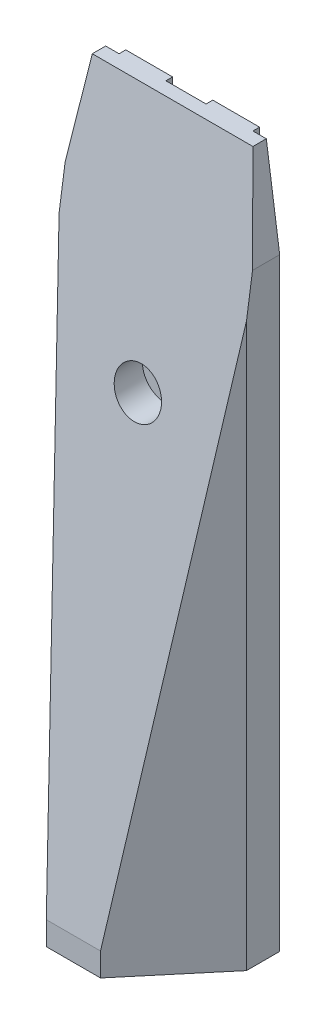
ISO-10303-21;
HEADER;
FILE_DESCRIPTION(('STEP AP214'),'2;1');
FILE_NAME('part.step','',(''),(''),'','','');
FILE_SCHEMA(('AUTOMOTIVE_DESIGN { 1 0 10303 214 1 1 1 1 }'));
ENDSEC;
DATA;
#1=APPLICATION_CONTEXT('core data for automotive mechanical design processes');
#2=APPLICATION_PROTOCOL_DEFINITION('international standard','automotive_design',2000,#1);
#3=PRODUCT_CONTEXT('',#1,'mechanical');
#4=PRODUCT('Part','Part','',(#3));
#5=PRODUCT_RELATED_PRODUCT_CATEGORY('part','',(#4));
#6=PRODUCT_DEFINITION_FORMATION('','',#4);
#7=PRODUCT_DEFINITION_CONTEXT('part definition',#1,'design');
#8=PRODUCT_DEFINITION('design','',#6,#7);
#9=PRODUCT_DEFINITION_SHAPE('','',#8);
#10=(LENGTH_UNIT() NAMED_UNIT(*) SI_UNIT(.MILLI.,.METRE.));
#11=(NAMED_UNIT(*) PLANE_ANGLE_UNIT() SI_UNIT($,.RADIAN.));
#12=(NAMED_UNIT(*) SI_UNIT($,.STERADIAN.) SOLID_ANGLE_UNIT());
#13=UNCERTAINTY_MEASURE_WITH_UNIT(LENGTH_MEASURE(1.E-05),#10,'distance_accuracy_value','');
#14=(GEOMETRIC_REPRESENTATION_CONTEXT(3) GLOBAL_UNCERTAINTY_ASSIGNED_CONTEXT((#13)) GLOBAL_UNIT_ASSIGNED_CONTEXT((#10,
#11,#12)) REPRESENTATION_CONTEXT('',''));
#15=CARTESIAN_POINT('',(0.,0.,0.));
#16=DIRECTION('',(0.,0.,1.));
#17=DIRECTION('',(1.,0.,0.));
#18=AXIS2_PLACEMENT_3D('',#15,#16,#17);
#19=CARTESIAN_POINT('',(10.85,38.08,0.));
#20=DIRECTION('',(-1.,0.,0.));
#21=DIRECTION('',(0.,0.,1.));
#22=AXIS2_PLACEMENT_3D('',#19,#20,#21);
#23=PLANE('',#22);
#24=DIRECTION('',(0.,0.,1.));
#25=VECTOR('',#24,1.);
#26=CARTESIAN_POINT('',(10.85,-48.58,0.));
#27=LINE('',#26,#25);
#28=CARTESIAN_POINT('',(10.85,-48.58,-0.999999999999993));
#29=VERTEX_POINT('',#28);
#30=CARTESIAN_POINT('',(10.85,-48.58,5.36952750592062));
#31=VERTEX_POINT('',#30);
#32=EDGE_CURVE('E586',#29,#31,#27,.T.);
#33=ORIENTED_EDGE('',*,*,#32,.T.);
#34=DIRECTION('',(0.,-1.,0.));
#35=VECTOR('',#34,1.);
#36=CARTESIAN_POINT('',(10.85,38.08,5.36952750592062));
#37=LINE('',#36,#35);
#38=CARTESIAN_POINT('',(10.85,18.8954987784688,5.36952750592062));
#39=VERTEX_POINT('',#38);
#40=EDGE_CURVE('E507',#39,#31,#37,.T.);
#41=ORIENTED_EDGE('',*,*,#40,.F.);
#42=DIRECTION('',(0.,0.989334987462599,-0.145658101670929));
#43=VECTOR('',#42,1.);
#44=CARTESIAN_POINT('',(10.85,38.4467501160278,2.49103014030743));
#45=LINE('',#44,#43);
#46=CARTESIAN_POINT('',(10.85,38.08,2.54502613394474));
#47=VERTEX_POINT('',#46);
#48=EDGE_CURVE('E409',#39,#47,#45,.T.);
#49=ORIENTED_EDGE('',*,*,#48,.T.);
#50=DIRECTION('',(0.,0.,1.));
#51=VECTOR('',#50,1.);
#52=CARTESIAN_POINT('',(10.85,38.08,0.));
#53=LINE('',#52,#51);
#54=CARTESIAN_POINT('',(10.85,38.0800000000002,0.));
#55=VERTEX_POINT('',#54);
#56=EDGE_CURVE('E522',#47,#55,#53,.F.);
#57=ORIENTED_EDGE('',*,*,#56,.T.);
#58=DIRECTION('',(0.,1.,0.));
#59=VECTOR('',#58,1.);
#60=CARTESIAN_POINT('',(10.85,33.08,0.));
#61=LINE('',#60,#59);
#62=CARTESIAN_POINT('',(10.85,33.08,0.));
#63=VERTEX_POINT('',#62);
#64=EDGE_CURVE('E544',#63,#55,#61,.T.);
#65=ORIENTED_EDGE('',*,*,#64,.F.);
#66=DIRECTION('',(0.,0.,1.));
#67=VECTOR('',#66,1.);
#68=CARTESIAN_POINT('',(10.85,33.08,-0.999999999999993));
#69=LINE('',#68,#67);
#70=CARTESIAN_POINT('',(10.85,33.08,-0.999999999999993));
#71=VERTEX_POINT('',#70);
#72=EDGE_CURVE('E601',#71,#63,#69,.T.);
#73=ORIENTED_EDGE('',*,*,#72,.F.);
#74=DIRECTION('',(0.,-1.,0.));
#75=VECTOR('',#74,1.);
#76=CARTESIAN_POINT('',(10.85,38.08,-0.999999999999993));
#77=LINE('',#76,#75);
#78=EDGE_CURVE('E521',#71,#29,#77,.T.);
#79=ORIENTED_EDGE('',*,*,#78,.T.);
#80=EDGE_LOOP('',(#33,#41,#49,#57,#65,#73,#79));
#81=FACE_BOUND('',#80,.T.);
#82=ADVANCED_FACE('F60',(#81),#23,.T.);
#83=CARTESIAN_POINT('',(-10.85,38.08,0.));
#84=DIRECTION('',(-1.,0.,0.));
#85=DIRECTION('',(0.,0.,1.));
#86=AXIS2_PLACEMENT_3D('',#83,#84,#85);
#87=PLANE('',#86);
#88=DIRECTION('',(0.,-1.,0.));
#89=VECTOR('',#88,1.);
#90=CARTESIAN_POINT('',(-10.85,38.08,5.36952750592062));
#91=LINE('',#90,#89);
#92=CARTESIAN_POINT('',(-10.85,18.8954987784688,5.36952750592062));
#93=VERTEX_POINT('',#92);
#94=CARTESIAN_POINT('',(-10.85,-48.58,5.36952750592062));
#95=VERTEX_POINT('',#94);
#96=EDGE_CURVE('E554',#93,#95,#91,.T.);
#97=ORIENTED_EDGE('',*,*,#96,.T.);
#98=DIRECTION('',(0.,0.,-1.));
#99=VECTOR('',#98,1.);
#100=CARTESIAN_POINT('',(-10.85,-48.58,0.));
#101=LINE('',#100,#99);
#102=CARTESIAN_POINT('',(-10.85,-48.58,-1.));
#103=VERTEX_POINT('',#102);
#104=EDGE_CURVE('E588',#95,#103,#101,.T.);
#105=ORIENTED_EDGE('',*,*,#104,.T.);
#106=DIRECTION('',(0.,-1.,0.));
#107=VECTOR('',#106,1.);
#108=CARTESIAN_POINT('',(-10.85,38.08,-1.));
#109=LINE('',#108,#107);
#110=CARTESIAN_POINT('',(-10.85,33.08,-1.));
#111=VERTEX_POINT('',#110);
#112=EDGE_CURVE('E557',#111,#103,#109,.T.);
#113=ORIENTED_EDGE('',*,*,#112,.F.);
#114=DIRECTION('',(0.,0.,-1.));
#115=VECTOR('',#114,1.);
#116=CARTESIAN_POINT('',(-10.85,33.08,-1.));
#117=LINE('',#116,#115);
#118=CARTESIAN_POINT('',(-10.85,33.08,0.));
#119=VERTEX_POINT('',#118);
#120=EDGE_CURVE('E546',#119,#111,#117,.T.);
#121=ORIENTED_EDGE('',*,*,#120,.F.);
#122=DIRECTION('',(0.,1.,0.));
#123=VECTOR('',#122,1.);
#124=CARTESIAN_POINT('',(-10.85,33.08,0.));
#125=LINE('',#124,#123);
#126=CARTESIAN_POINT('',(-10.85,38.0799999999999,0.));
#127=VERTEX_POINT('',#126);
#128=EDGE_CURVE('E525',#119,#127,#125,.T.);
#129=ORIENTED_EDGE('',*,*,#128,.T.);
#130=DIRECTION('',(0.,0.,1.));
#131=VECTOR('',#130,1.);
#132=CARTESIAN_POINT('',(-10.85,38.08,0.));
#133=LINE('',#132,#131);
#134=CARTESIAN_POINT('',(-10.85,38.08,2.54502613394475));
#135=VERTEX_POINT('',#134);
#136=EDGE_CURVE('E518',#135,#127,#133,.F.);
#137=ORIENTED_EDGE('',*,*,#136,.F.);
#138=DIRECTION('',(0.,0.989334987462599,-0.145658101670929));
#139=VECTOR('',#138,1.);
#140=CARTESIAN_POINT('',(-10.85,38.4467501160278,2.49103014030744));
#141=LINE('',#140,#139);
#142=EDGE_CURVE('E407',#93,#135,#141,.T.);
#143=ORIENTED_EDGE('',*,*,#142,.F.);
#144=EDGE_LOOP('',(#97,#105,#113,#121,#129,#137,#143));
#145=FACE_BOUND('',#144,.T.);
#146=ADVANCED_FACE('F623',(#145),#87,.F.);
#147=CARTESIAN_POINT('',(9.01184831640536,38.08,7.56053041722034));
#148=DIRECTION('',(-0.766099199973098,0.,-0.642722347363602));
#149=DIRECTION('',(-0.642722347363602,0.,0.766099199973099));
#150=AXIS2_PLACEMENT_3D('',#147,#148,#149);
#151=PLANE('',#150);
#152=ORIENTED_EDGE('',*,*,#40,.T.);
#153=DIRECTION('',(-0.642722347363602,0.,0.766099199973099));
#154=VECTOR('',#153,1.);
#155=CARTESIAN_POINT('',(9.01184831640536,-48.58,7.56053041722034));
#156=LINE('',#155,#154);
#157=CARTESIAN_POINT('',(3.04732703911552,-48.58,14.67));
#158=VERTEX_POINT('',#157);
#159=EDGE_CURVE('E348',#31,#158,#156,.T.);
#160=ORIENTED_EDGE('',*,*,#159,.T.);
#161=DIRECTION('',(0.,-1.,0.));
#162=VECTOR('',#161,1.);
#163=CARTESIAN_POINT('',(3.04732703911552,38.08,14.67));
#164=LINE('',#163,#162);
#165=CARTESIAN_POINT('',(3.04732703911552,-44.2749169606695,14.67));
#166=VERTEX_POINT('',#165);
#167=EDGE_CURVE('E511',#166,#158,#164,.T.);
#168=ORIENTED_EDGE('',*,*,#167,.F.);
#169=DIRECTION('',(0.121298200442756,0.982029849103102,-0.1445825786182));
#170=VECTOR('',#169,1.);
#171=CARTESIAN_POINT('',(13.0697579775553,36.8666523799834,2.72366523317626));
#172=LINE('',#171,#170);
#173=EDGE_CURVE('E416',#166,#39,#172,.T.);
#174=ORIENTED_EDGE('',*,*,#173,.T.);
#175=EDGE_LOOP('',(#152,#160,#168,#174));
#176=FACE_BOUND('',#175,.T.);
#177=ADVANCED_FACE('F640',(#176),#151,.T.);
#178=CARTESIAN_POINT('',(0.,38.08,14.67));
#179=DIRECTION('',(0.,0.,1.));
#180=DIRECTION('',(1.,0.,0.));
#181=AXIS2_PLACEMENT_3D('',#178,#179,#180);
#182=PLANE('',#181);
#183=DIRECTION('',(1.,0.,0.));
#184=VECTOR('',#183,1.);
#185=CARTESIAN_POINT('',(0.,-48.58,14.67));
#186=LINE('',#185,#184);
#187=CARTESIAN_POINT('',(-3.04732703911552,-48.58,14.67));
#188=VERTEX_POINT('',#187);
#189=EDGE_CURVE('E345',#188,#158,#186,.T.);
#190=ORIENTED_EDGE('',*,*,#189,.F.);
#191=DIRECTION('',(0.,-1.,0.));
#192=VECTOR('',#191,1.);
#193=CARTESIAN_POINT('',(-3.04732703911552,38.08,14.67));
#194=LINE('',#193,#192);
#195=CARTESIAN_POINT('',(-3.04732703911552,-44.2749169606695,14.67));
#196=VERTEX_POINT('',#195);
#197=EDGE_CURVE('E551',#196,#188,#194,.T.);
#198=ORIENTED_EDGE('',*,*,#197,.F.);
#199=DIRECTION('',(-1.,0.,0.));
#200=VECTOR('',#199,1.);
#201=CARTESIAN_POINT('',(-1.41099266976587E-13,-44.2749169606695,14.67));
#202=LINE('',#201,#200);
#203=EDGE_CURVE('E414',#166,#196,#202,.T.);
#204=ORIENTED_EDGE('',*,*,#203,.F.);
#205=ORIENTED_EDGE('',*,*,#167,.T.);
#206=EDGE_LOOP('',(#190,#198,#204,#205));
#207=FACE_BOUND('',#206,.T.);
#208=ADVANCED_FACE('F635',(#207),#182,.F.);
#209=CARTESIAN_POINT('',(-9.01184831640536,38.08,7.56053041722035));
#210=DIRECTION('',(-0.766099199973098,0.,0.642722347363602));
#211=DIRECTION('',(0.642722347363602,0.,0.766099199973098));
#212=AXIS2_PLACEMENT_3D('',#209,#210,#211);
#213=PLANE('',#212);
#214=DIRECTION('',(0.642722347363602,0.,0.766099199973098));
#215=VECTOR('',#214,1.);
#216=CARTESIAN_POINT('',(-9.01184831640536,-48.58,7.56053041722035));
#217=LINE('',#216,#215);
#218=EDGE_CURVE('E343',#95,#188,#217,.T.);
#219=ORIENTED_EDGE('',*,*,#218,.F.);
#220=ORIENTED_EDGE('',*,*,#96,.F.);
#221=DIRECTION('',(-0.121298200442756,0.982029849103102,-0.1445825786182));
#222=VECTOR('',#221,1.);
#223=CARTESIAN_POINT('',(-13.0697579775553,36.8666523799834,2.72366523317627));
#224=LINE('',#223,#222);
#225=EDGE_CURVE('E412',#196,#93,#224,.T.);
#226=ORIENTED_EDGE('',*,*,#225,.F.);
#227=ORIENTED_EDGE('',*,*,#197,.T.);
#228=EDGE_LOOP('',(#219,#220,#226,#227));
#229=FACE_BOUND('',#228,.T.);
#230=ADVANCED_FACE('F630',(#229),#213,.F.);
#231=CARTESIAN_POINT('',(0.,38.08,0.));
#232=DIRECTION('',(0.,0.,-1.));
#233=DIRECTION('',(-1.,0.,0.));
#234=AXIS2_PLACEMENT_3D('',#231,#232,#233);
#235=PLANE('',#234);
#236=DIRECTION('',(0.,-1.,0.));
#237=VECTOR('',#236,1.);
#238=CARTESIAN_POINT('',(-12.1,-48.58,0.));
#239=LINE('',#238,#237);
#240=CARTESIAN_POINT('',(-12.1,-48.58,0.));
#241=VERTEX_POINT('',#240);
#242=CARTESIAN_POINT('',(-12.1,-52.08,0.));
#243=VERTEX_POINT('',#242);
#244=EDGE_CURVE('E346',#241,#243,#239,.T.);
#245=ORIENTED_EDGE('',*,*,#244,.T.);
#246=DIRECTION('',(-1.,0.,0.));
#247=VECTOR('',#246,1.);
#248=CARTESIAN_POINT('',(0.,-52.08,0.));
#249=LINE('',#248,#247);
#250=CARTESIAN_POINT('',(-14.,-52.08,0.));
#251=VERTEX_POINT('',#250);
#252=EDGE_CURVE('E583',#243,#251,#249,.T.);
#253=ORIENTED_EDGE('',*,*,#252,.T.);
#254=DIRECTION('',(0.,-1.,0.));
#255=VECTOR('',#254,1.);
#256=CARTESIAN_POINT('',(-14.,38.08,0.));
#257=LINE('',#256,#255);
#258=CARTESIAN_POINT('',(-14.,38.08,0.));
#259=VERTEX_POINT('',#258);
#260=EDGE_CURVE('E529',#259,#251,#257,.T.);
#261=ORIENTED_EDGE('',*,*,#260,.F.);
#262=DIRECTION('',(0.141421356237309,0.989949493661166,0.));
#263=VECTOR('',#262,1.);
#264=CARTESIAN_POINT('',(-14.,38.08,0.));
#265=LINE('',#264,#263);
#266=CARTESIAN_POINT('',(-12.,52.08,0.));
#267=VERTEX_POINT('',#266);
#268=EDGE_CURVE('E452',#259,#267,#265,.T.);
#269=ORIENTED_EDGE('',*,*,#268,.T.);
#270=DIRECTION('',(-1.,0.,0.));
#271=VECTOR('',#270,1.);
#272=CARTESIAN_POINT('',(-12.,52.08,0.));
#273=LINE('',#272,#271);
#274=CARTESIAN_POINT('',(-10.,52.08,0.));
#275=VERTEX_POINT('',#274);
#276=EDGE_CURVE('E482',#275,#267,#273,.T.);
#277=ORIENTED_EDGE('',*,*,#276,.F.);
#278=DIRECTION('',(0.,1.,0.));
#279=VECTOR('',#278,1.);
#280=CARTESIAN_POINT('',(-10.,0.,0.));
#281=LINE('',#280,#279);
#282=CARTESIAN_POINT('',(-10.,46.08,0.));
#283=VERTEX_POINT('',#282);
#284=EDGE_CURVE('E360',#283,#275,#281,.T.);
#285=ORIENTED_EDGE('',*,*,#284,.F.);
#286=DIRECTION('',(-1.,0.,0.));
#287=VECTOR('',#286,1.);
#288=CARTESIAN_POINT('',(12.,46.08,0.));
#289=LINE('',#288,#287);
#290=CARTESIAN_POINT('',(-10.3642857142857,46.08,0.));
#291=VERTEX_POINT('',#290);
#292=EDGE_CURVE('E447',#283,#291,#289,.T.);
#293=ORIENTED_EDGE('',*,*,#292,.T.);
#294=DIRECTION('',(0.0606026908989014,0.998161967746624,0.));
#295=VECTOR('',#294,1.);
#296=CARTESIAN_POINT('',(-10.85,38.08,0.));
#297=LINE('',#296,#295);
#298=EDGE_CURVE('E453',#127,#291,#297,.T.);
#299=ORIENTED_EDGE('',*,*,#298,.F.);
#300=ORIENTED_EDGE('',*,*,#128,.F.);
#301=DIRECTION('',(1.,0.,0.));
#302=VECTOR('',#301,1.);
#303=CARTESIAN_POINT('',(-10.85,33.08,0.));
#304=LINE('',#303,#302);
#305=CARTESIAN_POINT('',(-11.85,33.08,0.));
#306=VERTEX_POINT('',#305);
#307=EDGE_CURVE('E528',#306,#119,#304,.T.);
#308=ORIENTED_EDGE('',*,*,#307,.F.);
#309=DIRECTION('',(0.,-1.,0.));
#310=VECTOR('',#309,1.);
#311=CARTESIAN_POINT('',(-11.85,38.08,0.));
#312=LINE('',#311,#310);
#313=CARTESIAN_POINT('',(-11.85,-48.58,0.));
#314=VERTEX_POINT('',#313);
#315=EDGE_CURVE('E532',#306,#314,#312,.T.);
#316=ORIENTED_EDGE('',*,*,#315,.T.);
#317=DIRECTION('',(1.,0.,0.));
#318=VECTOR('',#317,1.);
#319=CARTESIAN_POINT('',(-12.1,-48.58,0.));
#320=LINE('',#319,#318);
#321=EDGE_CURVE('E318',#241,#314,#320,.T.);
#322=ORIENTED_EDGE('',*,*,#321,.F.);
#323=EDGE_LOOP('',(#245,#253,#261,#269,#277,#285,#293,#299,#300,#308,#316,#322));
#324=FACE_BOUND('',#323,.T.);
#325=ADVANCED_FACE('F729',(#324),#235,.T.);
#326=CARTESIAN_POINT('',(3.,46.08,0.));
#327=VERTEX_POINT('',#326);
#328=CARTESIAN_POINT('',(-3.,46.08,0.));
#329=VERTEX_POINT('',#328);
#330=EDGE_CURVE('E446',#327,#329,#289,.T.);
#331=ORIENTED_EDGE('',*,*,#330,.T.);
#332=DIRECTION('',(0.,-1.,0.));
#333=VECTOR('',#332,1.);
#334=CARTESIAN_POINT('',(-3.00000000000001,0.,0.));
#335=LINE('',#334,#333);
#336=CARTESIAN_POINT('',(-3.,52.08,0.));
#337=VERTEX_POINT('',#336);
#338=EDGE_CURVE('E365',#337,#329,#335,.T.);
#339=ORIENTED_EDGE('',*,*,#338,.F.);
#340=CARTESIAN_POINT('',(3.,52.08,0.));
#341=VERTEX_POINT('',#340);
#342=EDGE_CURVE('E488',#341,#337,#273,.T.);
#343=ORIENTED_EDGE('',*,*,#342,.F.);
#344=DIRECTION('',(0.,-1.,0.));
#345=VECTOR('',#344,1.);
#346=CARTESIAN_POINT('',(2.99999999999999,0.,0.));
#347=LINE('',#346,#345);
#348=EDGE_CURVE('E83',#341,#327,#347,.T.);
#349=ORIENTED_EDGE('',*,*,#348,.T.);
#350=EDGE_LOOP('',(#331,#339,#343,#349));
#351=FACE_BOUND('',#350,.T.);
#352=ADVANCED_FACE('F767',(#351),#235,.T.);
#353=CARTESIAN_POINT('',(13.1136601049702,0.796186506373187,0.));
#354=DIRECTION('',(0.998161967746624,0.0606026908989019,0.));
#355=DIRECTION('',(-0.0606026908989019,0.998161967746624,0.));
#356=AXIS2_PLACEMENT_3D('',#353,#354,#355);
#357=PLANE('',#356);
#358=DIRECTION('',(0.0599586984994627,-0.987555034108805,0.14539604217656));
#359=VECTOR('',#358,1.);
#360=CARTESIAN_POINT('',(13.0436193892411,1.94979829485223,7.86441406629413));
#361=LINE('',#360,#359);
#362=CARTESIAN_POINT('',(10.3642857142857,46.08,1.3671997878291));
#363=VERTEX_POINT('',#362);
#364=EDGE_CURVE('E405',#363,#47,#361,.T.);
#365=ORIENTED_EDGE('',*,*,#364,.F.);
#366=DIRECTION('',(0.,0.,-1.));
#367=VECTOR('',#366,1.);
#368=CARTESIAN_POINT('',(10.3642857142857,46.08,0.));
#369=LINE('',#368,#367);
#370=CARTESIAN_POINT('',(10.3642857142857,46.08,0.));
#371=VERTEX_POINT('',#370);
#372=EDGE_CURVE('E445',#363,#371,#369,.T.);
#373=ORIENTED_EDGE('',*,*,#372,.T.);
#374=DIRECTION('',(-0.0606026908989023,0.998161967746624,0.));
#375=VECTOR('',#374,1.);
#376=CARTESIAN_POINT('',(10.85,38.08,0.));
#377=LINE('',#376,#375);
#378=EDGE_CURVE('E457',#55,#371,#377,.T.);
#379=ORIENTED_EDGE('',*,*,#378,.F.);
#380=ORIENTED_EDGE('',*,*,#56,.F.);
#381=EDGE_LOOP('',(#365,#373,#379,#380));
#382=FACE_BOUND('',#381,.T.);
#383=ADVANCED_FACE('F659',(#382),#357,.F.);
#384=CARTESIAN_POINT('',(-13.1136601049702,0.796186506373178,0.));
#385=DIRECTION('',(-0.998161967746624,0.0606026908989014,0.));
#386=DIRECTION('',(-0.0606026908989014,-0.998161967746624,0.));
#387=AXIS2_PLACEMENT_3D('',#384,#385,#386);
#388=PLANE('',#387);
#389=DIRECTION('',(0.059958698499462,0.987555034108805,-0.14539604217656));
#390=VECTOR('',#389,1.);
#391=CARTESIAN_POINT('',(-13.0436193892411,1.94979829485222,7.86441406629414));
#392=LINE('',#391,#390);
#393=CARTESIAN_POINT('',(-10.3642857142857,46.08,1.3671997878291));
#394=VERTEX_POINT('',#393);
#395=EDGE_CURVE('E403',#135,#394,#392,.T.);
#396=ORIENTED_EDGE('',*,*,#395,.F.);
#397=ORIENTED_EDGE('',*,*,#136,.T.);
#398=ORIENTED_EDGE('',*,*,#298,.T.);
#399=DIRECTION('',(0.,0.,1.));
#400=VECTOR('',#399,1.);
#401=CARTESIAN_POINT('',(-10.3642857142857,46.08,0.));
#402=LINE('',#401,#400);
#403=EDGE_CURVE('E502',#291,#394,#402,.T.);
#404=ORIENTED_EDGE('',*,*,#403,.T.);
#405=EDGE_LOOP('',(#396,#397,#398,#404));
#406=FACE_BOUND('',#405,.T.);
#407=ADVANCED_FACE('F782',(#406),#388,.F.);
#408=CARTESIAN_POINT('',(0.,46.08,0.));
#409=DIRECTION('',(0.,-1.,0.));
#410=DIRECTION('',(0.,0.,-1.));
#411=AXIS2_PLACEMENT_3D('',#408,#409,#410);
#412=PLANE('',#411);
#413=ORIENTED_EDGE('',*,*,#372,.F.);
#414=DIRECTION('',(-1.,0.,0.));
#415=VECTOR('',#414,1.);
#416=CARTESIAN_POINT('',(0.,46.08,1.3671997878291));
#417=LINE('',#416,#415);
#418=EDGE_CURVE('E491',#363,#394,#417,.T.);
#419=ORIENTED_EDGE('',*,*,#418,.T.);
#420=ORIENTED_EDGE('',*,*,#403,.F.);
#421=ORIENTED_EDGE('',*,*,#292,.F.);
#422=DIRECTION('',(0.,0.,1.));
#423=VECTOR('',#422,1.);
#424=CARTESIAN_POINT('',(-10.,46.08,-1.));
#425=LINE('',#424,#423);
#426=CARTESIAN_POINT('',(-10.,46.08,-1.));
#427=VERTEX_POINT('',#426);
#428=EDGE_CURVE('E379',#427,#283,#425,.T.);
#429=ORIENTED_EDGE('',*,*,#428,.F.);
#430=DIRECTION('',(-1.,0.,0.));
#431=VECTOR('',#430,1.);
#432=CARTESIAN_POINT('',(0.,46.08,-1.));
#433=LINE('',#432,#431);
#434=CARTESIAN_POINT('',(-3.,46.08,-1.));
#435=VERTEX_POINT('',#434);
#436=EDGE_CURVE('E361',#435,#427,#433,.T.);
#437=ORIENTED_EDGE('',*,*,#436,.F.);
#438=DIRECTION('',(0.,0.,1.));
#439=VECTOR('',#438,1.);
#440=CARTESIAN_POINT('',(-3.,46.08,-1.));
#441=LINE('',#440,#439);
#442=EDGE_CURVE('E371',#435,#329,#441,.T.);
#443=ORIENTED_EDGE('',*,*,#442,.T.);
#444=ORIENTED_EDGE('',*,*,#330,.F.);
#445=DIRECTION('',(0.,0.,1.));
#446=VECTOR('',#445,1.);
#447=CARTESIAN_POINT('',(3.,46.08,-1.));
#448=LINE('',#447,#446);
#449=CARTESIAN_POINT('',(3.,46.08,-1.));
#450=VERTEX_POINT('',#449);
#451=EDGE_CURVE('E392',#450,#327,#448,.T.);
#452=ORIENTED_EDGE('',*,*,#451,.F.);
#453=DIRECTION('',(-1.,0.,0.));
#454=VECTOR('',#453,1.);
#455=CARTESIAN_POINT('',(0.,46.08,-1.));
#456=LINE('',#455,#454);
#457=CARTESIAN_POINT('',(10.,46.08,-1.));
#458=VERTEX_POINT('',#457);
#459=EDGE_CURVE('E390',#458,#450,#456,.T.);
#460=ORIENTED_EDGE('',*,*,#459,.F.);
#461=DIRECTION('',(0.,0.,1.));
#462=VECTOR('',#461,1.);
#463=CARTESIAN_POINT('',(10.,46.08,-1.));
#464=LINE('',#463,#462);
#465=CARTESIAN_POINT('',(10.,46.08,0.));
#466=VERTEX_POINT('',#465);
#467=EDGE_CURVE('E397',#458,#466,#464,.T.);
#468=ORIENTED_EDGE('',*,*,#467,.T.);
#469=EDGE_CURVE('E442',#371,#466,#289,.T.);
#470=ORIENTED_EDGE('',*,*,#469,.F.);
#471=EDGE_LOOP('',(#413,#419,#420,#421,#429,#437,#443,#444,#452,#460,#468,#470));
#472=FACE_BOUND('',#471,.T.);
#473=ADVANCED_FACE('F662',(#472),#412,.T.);
#474=CARTESIAN_POINT('',(0.,38.08,-1.));
#475=DIRECTION('',(0.,0.,1.));
#476=DIRECTION('',(1.,0.,0.));
#477=AXIS2_PLACEMENT_3D('',#474,#475,#476);
#478=PLANE('',#477);
#479=DIRECTION('',(0.,-1.,0.));
#480=VECTOR('',#479,1.);
#481=CARTESIAN_POINT('',(-11.85,38.08,-1.));
#482=LINE('',#481,#480);
#483=CARTESIAN_POINT('',(-11.85,33.08,-1.));
#484=VERTEX_POINT('',#483);
#485=CARTESIAN_POINT('',(-11.85,-48.58,-1.));
#486=VERTEX_POINT('',#485);
#487=EDGE_CURVE('E559',#484,#486,#482,.T.);
#488=ORIENTED_EDGE('',*,*,#487,.F.);
#489=DIRECTION('',(-1.,0.,0.));
#490=VECTOR('',#489,1.);
#491=CARTESIAN_POINT('',(-10.85,33.08,-1.));
#492=LINE('',#491,#490);
#493=EDGE_CURVE('E610',#111,#484,#492,.T.);
#494=ORIENTED_EDGE('',*,*,#493,.F.);
#495=ORIENTED_EDGE('',*,*,#112,.T.);
#496=DIRECTION('',(-1.,0.,0.));
#497=VECTOR('',#496,1.);
#498=CARTESIAN_POINT('',(-11.85,-48.58,-1.));
#499=LINE('',#498,#497);
#500=EDGE_CURVE('E595',#103,#486,#499,.T.);
#501=ORIENTED_EDGE('',*,*,#500,.T.);
#502=EDGE_LOOP('',(#488,#494,#495,#501));
#503=FACE_BOUND('',#502,.T.);
#504=ADVANCED_FACE('F621',(#503),#478,.F.);
#505=CARTESIAN_POINT('',(-11.85,38.08,0.));
#506=DIRECTION('',(1.,0.,0.));
#507=DIRECTION('',(0.,0.,-1.));
#508=AXIS2_PLACEMENT_3D('',#505,#506,#507);
#509=PLANE('',#508);
#510=ORIENTED_EDGE('',*,*,#315,.F.);
#511=DIRECTION('',(0.,0.,1.));
#512=VECTOR('',#511,1.);
#513=CARTESIAN_POINT('',(-11.85,33.08,-1.));
#514=LINE('',#513,#512);
#515=EDGE_CURVE('E608',#484,#306,#514,.T.);
#516=ORIENTED_EDGE('',*,*,#515,.F.);
#517=ORIENTED_EDGE('',*,*,#487,.T.);
#518=DIRECTION('',(0.,0.,1.));
#519=VECTOR('',#518,1.);
#520=CARTESIAN_POINT('',(-11.85,-48.58,0.));
#521=LINE('',#520,#519);
#522=EDGE_CURVE('E585',#486,#314,#521,.T.);
#523=ORIENTED_EDGE('',*,*,#522,.T.);
#524=EDGE_LOOP('',(#510,#516,#517,#523));
#525=FACE_BOUND('',#524,.T.);
#526=ADVANCED_FACE('F731',(#525),#509,.F.);
#527=CARTESIAN_POINT('',(11.85,38.08,0.));
#528=DIRECTION('',(1.,0.,0.));
#529=DIRECTION('',(0.,0.,-1.));
#530=AXIS2_PLACEMENT_3D('',#527,#528,#529);
#531=PLANE('',#530);
#532=DIRECTION('',(0.,0.,-1.));
#533=VECTOR('',#532,1.);
#534=CARTESIAN_POINT('',(11.85,33.08,-0.999999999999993));
#535=LINE('',#534,#533);
#536=CARTESIAN_POINT('',(11.85,33.08,0.));
#537=VERTEX_POINT('',#536);
#538=CARTESIAN_POINT('',(11.85,33.08,-0.999999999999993));
#539=VERTEX_POINT('',#538);
#540=EDGE_CURVE('E487',#537,#539,#535,.T.);
#541=ORIENTED_EDGE('',*,*,#540,.F.);
#542=DIRECTION('',(0.,-1.,0.));
#543=VECTOR('',#542,1.);
#544=CARTESIAN_POINT('',(11.85,38.08,0.));
#545=LINE('',#544,#543);
#546=CARTESIAN_POINT('',(11.85,-48.58,0.));
#547=VERTEX_POINT('',#546);
#548=EDGE_CURVE('E543',#537,#547,#545,.T.);
#549=ORIENTED_EDGE('',*,*,#548,.T.);
#550=DIRECTION('',(0.,0.,-1.));
#551=VECTOR('',#550,1.);
#552=CARTESIAN_POINT('',(11.85,-48.58,0.));
#553=LINE('',#552,#551);
#554=CARTESIAN_POINT('',(11.85,-48.58,-0.999999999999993));
#555=VERTEX_POINT('',#554);
#556=EDGE_CURVE('E313',#547,#555,#553,.T.);
#557=ORIENTED_EDGE('',*,*,#556,.T.);
#558=DIRECTION('',(0.,-1.,0.));
#559=VECTOR('',#558,1.);
#560=CARTESIAN_POINT('',(11.85,38.08,-0.999999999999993));
#561=LINE('',#560,#559);
#562=EDGE_CURVE('E564',#539,#555,#561,.T.);
#563=ORIENTED_EDGE('',*,*,#562,.F.);
#564=EDGE_LOOP('',(#541,#549,#557,#563));
#565=FACE_BOUND('',#564,.T.);
#566=ADVANCED_FACE('F652',(#565),#531,.T.);
#567=CARTESIAN_POINT('',(0.,38.08,-0.999999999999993));
#568=DIRECTION('',(0.,0.,-1.));
#569=DIRECTION('',(-1.,0.,0.));
#570=AXIS2_PLACEMENT_3D('',#567,#568,#569);
#571=PLANE('',#570);
#572=DIRECTION('',(-1.,0.,0.));
#573=VECTOR('',#572,1.);
#574=CARTESIAN_POINT('',(11.85,33.08,-0.999999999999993));
#575=LINE('',#574,#573);
#576=EDGE_CURVE('E603',#539,#71,#575,.T.);
#577=ORIENTED_EDGE('',*,*,#576,.F.);
#578=ORIENTED_EDGE('',*,*,#562,.T.);
#579=DIRECTION('',(-1.,0.,0.));
#580=VECTOR('',#579,1.);
#581=CARTESIAN_POINT('',(10.85,-48.58,-0.999999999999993));
#582=LINE('',#581,#580);
#583=EDGE_CURVE('E589',#555,#29,#582,.T.);
#584=ORIENTED_EDGE('',*,*,#583,.T.);
#585=ORIENTED_EDGE('',*,*,#78,.F.);
#586=EDGE_LOOP('',(#577,#578,#584,#585));
#587=FACE_BOUND('',#586,.T.);
#588=ADVANCED_FACE('F648',(#587),#571,.T.);
#589=CARTESIAN_POINT('',(0.,-52.08,0.));
#590=DIRECTION('',(0.,1.,0.));
#591=DIRECTION('',(0.,0.,1.));
#592=AXIS2_PLACEMENT_3D('',#589,#590,#591);
#593=PLANE('',#592);
#594=ORIENTED_EDGE('',*,*,#252,.F.);
#595=DIRECTION('',(0.,0.,-1.));
#596=VECTOR('',#595,1.);
#597=CARTESIAN_POINT('',(-12.1,-52.08,0.));
#598=LINE('',#597,#596);
#599=CARTESIAN_POINT('',(-12.1,-52.08,4.26854820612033));
#600=VERTEX_POINT('',#599);
#601=EDGE_CURVE('E319',#600,#243,#598,.T.);
#602=ORIENTED_EDGE('',*,*,#601,.F.);
#603=DIRECTION('',(-0.642722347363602,0.,-0.766099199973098));
#604=VECTOR('',#603,1.);
#605=CARTESIAN_POINT('',(-12.1,-52.08,4.26854820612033));
#606=LINE('',#605,#604);
#607=CARTESIAN_POINT('',(-3.16391691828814,-52.08,14.92));
#608=VERTEX_POINT('',#607);
#609=EDGE_CURVE('E701',#608,#600,#606,.T.);
#610=ORIENTED_EDGE('',*,*,#609,.F.);
#611=DIRECTION('',(-1.,0.,0.));
#612=VECTOR('',#611,1.);
#613=CARTESIAN_POINT('',(-3.16391691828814,-52.08,14.92));
#614=LINE('',#613,#612);
#615=CARTESIAN_POINT('',(3.16391691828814,-52.08,14.92));
#616=VERTEX_POINT('',#615);
#617=EDGE_CURVE('E695',#616,#608,#614,.T.);
#618=ORIENTED_EDGE('',*,*,#617,.F.);
#619=DIRECTION('',(-0.642722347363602,0.,0.766099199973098));
#620=VECTOR('',#619,1.);
#621=CARTESIAN_POINT('',(12.1,-52.08,4.26854820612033));
#622=LINE('',#621,#620);
#623=CARTESIAN_POINT('',(12.1,-52.08,4.26854820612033));
#624=VERTEX_POINT('',#623);
#625=EDGE_CURVE('E693',#624,#616,#622,.T.);
#626=ORIENTED_EDGE('',*,*,#625,.F.);
#627=DIRECTION('',(0.,0.,1.));
#628=VECTOR('',#627,1.);
#629=CARTESIAN_POINT('',(12.1,-52.08,0.));
#630=LINE('',#629,#628);
#631=CARTESIAN_POINT('',(12.1,-52.08,0.));
#632=VERTEX_POINT('',#631);
#633=EDGE_CURVE('E690',#632,#624,#630,.T.);
#634=ORIENTED_EDGE('',*,*,#633,.F.);
#635=DIRECTION('',(1.,0.,0.));
#636=VECTOR('',#635,1.);
#637=CARTESIAN_POINT('',(0.,-52.08,0.));
#638=LINE('',#637,#636);
#639=CARTESIAN_POINT('',(14.,-52.08,0.));
#640=VERTEX_POINT('',#639);
#641=EDGE_CURVE('E333',#632,#640,#638,.T.);
#642=ORIENTED_EDGE('',*,*,#641,.T.);
#643=DIRECTION('',(0.,0.,1.));
#644=VECTOR('',#643,1.);
#645=CARTESIAN_POINT('',(14.,-52.08,0.));
#646=LINE('',#645,#644);
#647=CARTESIAN_POINT('',(14.,-52.08,4.96));
#648=VERTEX_POINT('',#647);
#649=EDGE_CURVE('E568',#640,#648,#646,.T.);
#650=ORIENTED_EDGE('',*,*,#649,.T.);
#651=DIRECTION('',(0.642722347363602,0.,-0.766099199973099));
#652=VECTOR('',#651,1.);
#653=CARTESIAN_POINT('',(10.6589615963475,-52.08,8.94238346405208));
#654=LINE('',#653,#652);
#655=CARTESIAN_POINT('',(4.05,-52.08,16.82));
#656=VERTEX_POINT('',#655);
#657=EDGE_CURVE('E571',#656,#648,#654,.T.);
#658=ORIENTED_EDGE('',*,*,#657,.F.);
#659=DIRECTION('',(-1.,0.,0.));
#660=VECTOR('',#659,1.);
#661=CARTESIAN_POINT('',(0.,-52.08,16.82));
#662=LINE('',#661,#660);
#663=CARTESIAN_POINT('',(-4.05,-52.08,16.82));
#664=VERTEX_POINT('',#663);
#665=EDGE_CURVE('E574',#656,#664,#662,.T.);
#666=ORIENTED_EDGE('',*,*,#665,.T.);
#667=DIRECTION('',(-0.642722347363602,0.,-0.766099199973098));
#668=VECTOR('',#667,1.);
#669=CARTESIAN_POINT('',(-10.6589615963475,-52.08,8.94238346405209));
#670=LINE('',#669,#668);
#671=CARTESIAN_POINT('',(-14.,-52.08,4.96));
#672=VERTEX_POINT('',#671);
#673=EDGE_CURVE('E577',#664,#672,#670,.T.);
#674=ORIENTED_EDGE('',*,*,#673,.T.);
#675=DIRECTION('',(0.,0.,1.));
#676=VECTOR('',#675,1.);
#677=CARTESIAN_POINT('',(-14.,-52.08,0.));
#678=LINE('',#677,#676);
#679=EDGE_CURVE('E580',#251,#672,#678,.T.);
#680=ORIENTED_EDGE('',*,*,#679,.F.);
#681=EDGE_LOOP('',(#594,#602,#610,#618,#626,#634,#642,#650,#658,#666,#674,#680));
#682=FACE_BOUND('',#681,.T.);
#683=ADVANCED_FACE('F687',(#682),#593,.F.);
#684=CARTESIAN_POINT('',(-14.,38.08,0.));
#685=DIRECTION('',(1.,0.,0.));
#686=DIRECTION('',(0.,0.,-1.));
#687=AXIS2_PLACEMENT_3D('',#684,#685,#686);
#688=PLANE('',#687);
#689=DIRECTION('',(0.,0.989334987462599,-0.145658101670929));
#690=VECTOR('',#689,1.);
#691=CARTESIAN_POINT('',(-14.,38.6652372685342,3.97503262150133));
#692=LINE('',#691,#690);
#693=CARTESIAN_POINT('',(-14.,31.9751686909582,4.96));
#694=VERTEX_POINT('',#693);
#695=CARTESIAN_POINT('',(-14.,38.08,4.06119610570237));
#696=VERTEX_POINT('',#695);
#697=EDGE_CURVE('E433',#694,#696,#692,.T.);
#698=ORIENTED_EDGE('',*,*,#697,.T.);
#699=DIRECTION('',(0.,0.,1.));
#700=VECTOR('',#699,1.);
#701=CARTESIAN_POINT('',(-14.,38.08,0.));
#702=LINE('',#701,#700);
#703=EDGE_CURVE('E514',#259,#696,#702,.T.);
#704=ORIENTED_EDGE('',*,*,#703,.F.);
#705=ORIENTED_EDGE('',*,*,#260,.T.);
#706=ORIENTED_EDGE('',*,*,#679,.T.);
#707=DIRECTION('',(0.,-1.,0.));
#708=VECTOR('',#707,1.);
#709=CARTESIAN_POINT('',(-14.,38.08,4.96));
#710=LINE('',#709,#708);
#711=EDGE_CURVE('E533',#694,#672,#710,.T.);
#712=ORIENTED_EDGE('',*,*,#711,.F.);
#713=EDGE_LOOP('',(#698,#704,#705,#706,#712));
#714=FACE_BOUND('',#713,.T.);
#715=ADVANCED_FACE('F846',(#714),#688,.F.);
#716=CARTESIAN_POINT('',(-10.6589615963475,38.08,8.94238346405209));
#717=DIRECTION('',(-0.766099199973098,0.,0.642722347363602));
#718=DIRECTION('',(0.642722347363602,0.,0.766099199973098));
#719=AXIS2_PLACEMENT_3D('',#716,#717,#718);
#720=PLANE('',#719);
#721=DIRECTION('',(0.121298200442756,-0.982029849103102,0.1445825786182));
#722=VECTOR('',#721,1.);
#723=CARTESIAN_POINT('',(-14.6081990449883,36.899146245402,4.23505118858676));
#724=LINE('',#723,#722);
#725=CARTESIAN_POINT('',(-4.05,-48.58,16.82));
#726=VERTEX_POINT('',#725);
#727=EDGE_CURVE('E431',#694,#726,#724,.T.);
#728=ORIENTED_EDGE('',*,*,#727,.F.);
#729=ORIENTED_EDGE('',*,*,#711,.T.);
#730=ORIENTED_EDGE('',*,*,#673,.F.);
#731=DIRECTION('',(0.,-1.,0.));
#732=VECTOR('',#731,1.);
#733=CARTESIAN_POINT('',(-4.05,38.08,16.82));
#734=LINE('',#733,#732);
#735=EDGE_CURVE('E535',#726,#664,#734,.T.);
#736=ORIENTED_EDGE('',*,*,#735,.F.);
#737=EDGE_LOOP('',(#728,#729,#730,#736));
#738=FACE_BOUND('',#737,.T.);
#739=ADVANCED_FACE('F840',(#738),#720,.T.);
#740=CARTESIAN_POINT('',(0.,38.08,16.82));
#741=DIRECTION('',(0.,0.,1.));
#742=DIRECTION('',(1.,0.,0.));
#743=AXIS2_PLACEMENT_3D('',#740,#741,#742);
#744=PLANE('',#743);
#745=DIRECTION('',(1.,0.,0.));
#746=VECTOR('',#745,1.);
#747=CARTESIAN_POINT('',(0.,-48.58,16.82));
#748=LINE('',#747,#746);
#749=CARTESIAN_POINT('',(4.05,-48.58,16.82));
#750=VERTEX_POINT('',#749);
#751=EDGE_CURVE('E429',#726,#750,#748,.T.);
#752=ORIENTED_EDGE('',*,*,#751,.F.);
#753=ORIENTED_EDGE('',*,*,#735,.T.);
#754=ORIENTED_EDGE('',*,*,#665,.F.);
#755=DIRECTION('',(0.,-1.,0.));
#756=VECTOR('',#755,1.);
#757=CARTESIAN_POINT('',(4.05,38.08,16.82));
#758=LINE('',#757,#756);
#759=EDGE_CURVE('E537',#750,#656,#758,.T.);
#760=ORIENTED_EDGE('',*,*,#759,.F.);
#761=EDGE_LOOP('',(#752,#753,#754,#760));
#762=FACE_BOUND('',#761,.T.);
#763=ADVANCED_FACE('F845',(#762),#744,.T.);
#764=CARTESIAN_POINT('',(10.6589615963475,38.08,8.94238346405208));
#765=DIRECTION('',(-0.766099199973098,0.,-0.642722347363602));
#766=DIRECTION('',(-0.642722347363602,0.,0.766099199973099));
#767=AXIS2_PLACEMENT_3D('',#764,#765,#766);
#768=PLANE('',#767);
#769=DIRECTION('',(0.,-1.,0.));
#770=VECTOR('',#769,1.);
#771=CARTESIAN_POINT('',(14.,38.08,4.96));
#772=LINE('',#771,#770);
#773=CARTESIAN_POINT('',(14.,31.9751686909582,4.96));
#774=VERTEX_POINT('',#773);
#775=EDGE_CURVE('E539',#774,#648,#772,.T.);
#776=ORIENTED_EDGE('',*,*,#775,.F.);
#777=DIRECTION('',(-0.121298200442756,-0.982029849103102,0.1445825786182));
#778=VECTOR('',#777,1.);
#779=CARTESIAN_POINT('',(14.6081990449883,36.899146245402,4.23505118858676));
#780=LINE('',#779,#778);
#781=EDGE_CURVE('E426',#774,#750,#780,.T.);
#782=ORIENTED_EDGE('',*,*,#781,.T.);
#783=ORIENTED_EDGE('',*,*,#759,.T.);
#784=ORIENTED_EDGE('',*,*,#657,.T.);
#785=EDGE_LOOP('',(#776,#782,#783,#784));
#786=FACE_BOUND('',#785,.T.);
#787=ADVANCED_FACE('F858',(#786),#768,.F.);
#788=CARTESIAN_POINT('',(14.,38.08,0.));
#789=DIRECTION('',(1.,0.,0.));
#790=DIRECTION('',(0.,0.,-1.));
#791=AXIS2_PLACEMENT_3D('',#788,#789,#790);
#792=PLANE('',#791);
#793=DIRECTION('',(0.,0.,-1.));
#794=VECTOR('',#793,1.);
#795=CARTESIAN_POINT('',(14.,38.08,0.));
#796=LINE('',#795,#794);
#797=CARTESIAN_POINT('',(14.,38.08,0.));
#798=VERTEX_POINT('',#797);
#799=CARTESIAN_POINT('',(14.,38.08,4.06119610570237));
#800=VERTEX_POINT('',#799);
#801=EDGE_CURVE('E517',#798,#800,#796,.F.);
#802=ORIENTED_EDGE('',*,*,#801,.T.);
#803=DIRECTION('',(0.,0.989334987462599,-0.145658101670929));
#804=VECTOR('',#803,1.);
#805=CARTESIAN_POINT('',(14.,38.6652372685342,3.97503262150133));
#806=LINE('',#805,#804);
#807=EDGE_CURVE('E422',#774,#800,#806,.T.);
#808=ORIENTED_EDGE('',*,*,#807,.F.);
#809=ORIENTED_EDGE('',*,*,#775,.T.);
#810=ORIENTED_EDGE('',*,*,#649,.F.);
#811=DIRECTION('',(0.,-1.,0.));
#812=VECTOR('',#811,1.);
#813=CARTESIAN_POINT('',(14.,38.08,0.));
#814=LINE('',#813,#812);
#815=EDGE_CURVE('E541',#798,#640,#814,.T.);
#816=ORIENTED_EDGE('',*,*,#815,.F.);
#817=EDGE_LOOP('',(#802,#808,#809,#810,#816));
#818=FACE_BOUND('',#817,.T.);
#819=ADVANCED_FACE('F682',(#818),#792,.T.);
#820=DIRECTION('',(0.,-1.,0.));
#821=VECTOR('',#820,1.);
#822=CARTESIAN_POINT('',(12.1,-48.58,0.));
#823=LINE('',#822,#821);
#824=CARTESIAN_POINT('',(12.1,-48.58,0.));
#825=VERTEX_POINT('',#824);
#826=EDGE_CURVE('E324',#825,#632,#823,.T.);
#827=ORIENTED_EDGE('',*,*,#826,.F.);
#828=EDGE_CURVE('E306',#547,#825,#320,.T.);
#829=ORIENTED_EDGE('',*,*,#828,.F.);
#830=ORIENTED_EDGE('',*,*,#548,.F.);
#831=DIRECTION('',(1.,0.,0.));
#832=VECTOR('',#831,1.);
#833=CARTESIAN_POINT('',(11.85,33.08,0.));
#834=LINE('',#833,#832);
#835=EDGE_CURVE('E547',#63,#537,#834,.T.);
#836=ORIENTED_EDGE('',*,*,#835,.F.);
#837=ORIENTED_EDGE('',*,*,#64,.T.);
#838=ORIENTED_EDGE('',*,*,#378,.T.);
#839=ORIENTED_EDGE('',*,*,#469,.T.);
#840=DIRECTION('',(0.,1.,0.));
#841=VECTOR('',#840,1.);
#842=CARTESIAN_POINT('',(9.99999999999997,0.,0.));
#843=LINE('',#842,#841);
#844=CARTESIAN_POINT('',(10.,52.08,0.));
#845=VERTEX_POINT('',#844);
#846=EDGE_CURVE('E385',#466,#845,#843,.T.);
#847=ORIENTED_EDGE('',*,*,#846,.T.);
#848=CARTESIAN_POINT('',(12.,52.08,0.));
#849=VERTEX_POINT('',#848);
#850=EDGE_CURVE('E484',#849,#845,#273,.T.);
#851=ORIENTED_EDGE('',*,*,#850,.F.);
#852=DIRECTION('',(-0.141421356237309,0.989949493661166,0.));
#853=VECTOR('',#852,1.);
#854=CARTESIAN_POINT('',(14.,38.08,0.));
#855=LINE('',#854,#853);
#856=EDGE_CURVE('E462',#798,#849,#855,.T.);
#857=ORIENTED_EDGE('',*,*,#856,.F.);
#858=ORIENTED_EDGE('',*,*,#815,.T.);
#859=ORIENTED_EDGE('',*,*,#641,.F.);
#860=EDGE_LOOP('',(#827,#829,#830,#836,#837,#838,#839,#847,#851,#857,#858,#859));
#861=FACE_BOUND('',#860,.T.);
#862=ADVANCED_FACE('F331',(#861),#235,.T.);
#863=CARTESIAN_POINT('',(0.,-48.58,0.));
#864=DIRECTION('',(0.,-1.,0.));
#865=DIRECTION('',(0.,0.,-1.));
#866=AXIS2_PLACEMENT_3D('',#863,#864,#865);
#867=PLANE('',#866);
#868=ORIENTED_EDGE('',*,*,#104,.F.);
#869=ORIENTED_EDGE('',*,*,#218,.T.);
#870=ORIENTED_EDGE('',*,*,#189,.T.);
#871=ORIENTED_EDGE('',*,*,#159,.F.);
#872=ORIENTED_EDGE('',*,*,#32,.F.);
#873=ORIENTED_EDGE('',*,*,#583,.F.);
#874=ORIENTED_EDGE('',*,*,#556,.F.);
#875=ORIENTED_EDGE('',*,*,#828,.T.);
#876=DIRECTION('',(0.,0.,1.));
#877=VECTOR('',#876,1.);
#878=CARTESIAN_POINT('',(12.1,-48.58,0.));
#879=LINE('',#878,#877);
#880=CARTESIAN_POINT('',(12.1,-48.58,4.26854820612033));
#881=VERTEX_POINT('',#880);
#882=EDGE_CURVE('E310',#825,#881,#879,.T.);
#883=ORIENTED_EDGE('',*,*,#882,.T.);
#884=DIRECTION('',(-0.642722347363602,0.,0.766099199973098));
#885=VECTOR('',#884,1.);
#886=CARTESIAN_POINT('',(12.1,-48.58,4.26854820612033));
#887=LINE('',#886,#885);
#888=CARTESIAN_POINT('',(3.16391691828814,-48.58,14.92));
#889=VERTEX_POINT('',#888);
#890=EDGE_CURVE('E328',#881,#889,#887,.T.);
#891=ORIENTED_EDGE('',*,*,#890,.T.);
#892=DIRECTION('',(-1.,0.,0.));
#893=VECTOR('',#892,1.);
#894=CARTESIAN_POINT('',(-3.16391691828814,-48.58,14.92));
#895=LINE('',#894,#893);
#896=CARTESIAN_POINT('',(-3.16391691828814,-48.58,14.92));
#897=VERTEX_POINT('',#896);
#898=EDGE_CURVE('E715',#889,#897,#895,.T.);
#899=ORIENTED_EDGE('',*,*,#898,.T.);
#900=DIRECTION('',(-0.642722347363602,0.,-0.766099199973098));
#901=VECTOR('',#900,1.);
#902=CARTESIAN_POINT('',(-12.1,-48.58,4.26854820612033));
#903=LINE('',#902,#901);
#904=CARTESIAN_POINT('',(-12.1,-48.58,4.26854820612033));
#905=VERTEX_POINT('',#904);
#906=EDGE_CURVE('E339',#897,#905,#903,.T.);
#907=ORIENTED_EDGE('',*,*,#906,.T.);
#908=DIRECTION('',(0.,0.,-1.));
#909=VECTOR('',#908,1.);
#910=CARTESIAN_POINT('',(-12.1,-48.58,0.));
#911=LINE('',#910,#909);
#912=EDGE_CURVE('E334',#905,#241,#911,.T.);
#913=ORIENTED_EDGE('',*,*,#912,.T.);
#914=ORIENTED_EDGE('',*,*,#321,.T.);
#915=ORIENTED_EDGE('',*,*,#522,.F.);
#916=ORIENTED_EDGE('',*,*,#500,.F.);
#917=EDGE_LOOP('',(#868,#869,#870,#871,#872,#873,#874,#875,#883,#891,#899,#907,#913,#914,#915,#916));
#918=FACE_BOUND('',#917,.T.);
#919=ADVANCED_FACE('F308',(#918),#867,.T.);
#920=CARTESIAN_POINT('',(0.,33.08,0.));
#921=DIRECTION('',(0.,-1.,0.));
#922=DIRECTION('',(0.,0.,-1.));
#923=AXIS2_PLACEMENT_3D('',#920,#921,#922);
#924=PLANE('',#923);
#925=ORIENTED_EDGE('',*,*,#540,.T.);
#926=ORIENTED_EDGE('',*,*,#576,.T.);
#927=ORIENTED_EDGE('',*,*,#72,.T.);
#928=ORIENTED_EDGE('',*,*,#835,.T.);
#929=EDGE_LOOP('',(#925,#926,#927,#928));
#930=FACE_BOUND('',#929,.T.);
#931=ADVANCED_FACE('F819',(#930),#924,.F.);
#932=CARTESIAN_POINT('',(0.,33.08,0.));
#933=DIRECTION('',(0.,-1.,0.));
#934=DIRECTION('',(0.,0.,-1.));
#935=AXIS2_PLACEMENT_3D('',#932,#933,#934);
#936=PLANE('',#935);
#937=ORIENTED_EDGE('',*,*,#120,.T.);
#938=ORIENTED_EDGE('',*,*,#493,.T.);
#939=ORIENTED_EDGE('',*,*,#515,.T.);
#940=ORIENTED_EDGE('',*,*,#307,.T.);
#941=EDGE_LOOP('',(#937,#938,#939,#940));
#942=FACE_BOUND('',#941,.T.);
#943=ADVANCED_FACE('F614',(#942),#936,.F.);
#944=CARTESIAN_POINT('',(0.,52.08,0.));
#945=DIRECTION('',(0.,1.,0.));
#946=DIRECTION('',(0.,0.,1.));
#947=AXIS2_PLACEMENT_3D('',#944,#945,#946);
#948=PLANE('',#947);
#949=DIRECTION('',(1.,0.,0.));
#950=VECTOR('',#949,1.);
#951=CARTESIAN_POINT('',(12.,52.08,2.));
#952=LINE('',#951,#950);
#953=CARTESIAN_POINT('',(-12.,52.08,2.00000000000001));
#954=VERTEX_POINT('',#953);
#955=CARTESIAN_POINT('',(12.,52.08,2.));
#956=VERTEX_POINT('',#955);
#957=EDGE_CURVE('E439',#954,#956,#952,.T.);
#958=ORIENTED_EDGE('',*,*,#957,.T.);
#959=DIRECTION('',(0.,0.,-1.));
#960=VECTOR('',#959,1.);
#961=CARTESIAN_POINT('',(12.,52.08,4.23215600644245));
#962=LINE('',#961,#960);
#963=EDGE_CURVE('E456',#956,#849,#962,.T.);
#964=ORIENTED_EDGE('',*,*,#963,.T.);
#965=ORIENTED_EDGE('',*,*,#850,.T.);
#966=DIRECTION('',(0.,0.,1.));
#967=VECTOR('',#966,1.);
#968=CARTESIAN_POINT('',(10.,52.08,-1.));
#969=LINE('',#968,#967);
#970=CARTESIAN_POINT('',(10.,52.08,-1.));
#971=VERTEX_POINT('',#970);
#972=EDGE_CURVE('E399',#971,#845,#969,.T.);
#973=ORIENTED_EDGE('',*,*,#972,.F.);
#974=DIRECTION('',(1.,0.,0.));
#975=VECTOR('',#974,1.);
#976=CARTESIAN_POINT('',(0.,52.08,-1.));
#977=LINE('',#976,#975);
#978=CARTESIAN_POINT('',(3.,52.08,-1.));
#979=VERTEX_POINT('',#978);
#980=EDGE_CURVE('E384',#979,#971,#977,.T.);
#981=ORIENTED_EDGE('',*,*,#980,.F.);
#982=DIRECTION('',(0.,0.,1.));
#983=VECTOR('',#982,1.);
#984=CARTESIAN_POINT('',(3.,52.08,-1.));
#985=LINE('',#984,#983);
#986=EDGE_CURVE('E401',#979,#341,#985,.T.);
#987=ORIENTED_EDGE('',*,*,#986,.T.);
#988=ORIENTED_EDGE('',*,*,#342,.T.);
#989=DIRECTION('',(0.,0.,1.));
#990=VECTOR('',#989,1.);
#991=CARTESIAN_POINT('',(-3.,52.08,-1.));
#992=LINE('',#991,#990);
#993=CARTESIAN_POINT('',(-3.,52.08,-1.));
#994=VERTEX_POINT('',#993);
#995=EDGE_CURVE('E376',#994,#337,#992,.T.);
#996=ORIENTED_EDGE('',*,*,#995,.F.);
#997=DIRECTION('',(1.,0.,0.));
#998=VECTOR('',#997,1.);
#999=CARTESIAN_POINT('',(0.,52.08,-1.));
#1000=LINE('',#999,#998);
#1001=CARTESIAN_POINT('',(-10.,52.08,-1.));
#1002=VERTEX_POINT('',#1001);
#1003=EDGE_CURVE('E367',#1002,#994,#1000,.T.);
#1004=ORIENTED_EDGE('',*,*,#1003,.F.);
#1005=DIRECTION('',(0.,0.,1.));
#1006=VECTOR('',#1005,1.);
#1007=CARTESIAN_POINT('',(-10.,52.08,-1.));
#1008=LINE('',#1007,#1006);
#1009=EDGE_CURVE('E75',#1002,#275,#1008,.T.);
#1010=ORIENTED_EDGE('',*,*,#1009,.T.);
#1011=ORIENTED_EDGE('',*,*,#276,.T.);
#1012=DIRECTION('',(0.,0.,1.));
#1013=VECTOR('',#1012,1.);
#1014=CARTESIAN_POINT('',(-12.,52.08,0.));
#1015=LINE('',#1014,#1013);
#1016=EDGE_CURVE('E478',#267,#954,#1015,.T.);
#1017=ORIENTED_EDGE('',*,*,#1016,.T.);
#1018=EDGE_LOOP('',(#958,#964,#965,#973,#981,#987,#988,#996,#1004,#1010,#1011,#1017));
#1019=FACE_BOUND('',#1018,.T.);
#1020=ADVANCED_FACE('F670',(#1019),#948,.T.);
#1021=CARTESIAN_POINT('',(-19.0512,2.72159999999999,0.));
#1022=DIRECTION('',(0.989949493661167,-0.141421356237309,0.));
#1023=DIRECTION('',(0.141421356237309,0.989949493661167,0.));
#1024=AXIS2_PLACEMENT_3D('',#1021,#1022,#1023);
#1025=PLANE('',#1024);
#1026=ORIENTED_EDGE('',*,*,#703,.T.);
#1027=DIRECTION('',(0.139942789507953,0.979599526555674,-0.14422476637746));
#1028=VECTOR('',#1027,1.);
#1029=CARTESIAN_POINT('',(-18.8641630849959,4.03085840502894,9.07419310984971));
#1030=LINE('',#1029,#1028);
#1031=EDGE_CURVE('E436',#696,#954,#1030,.T.);
#1032=ORIENTED_EDGE('',*,*,#1031,.T.);
#1033=ORIENTED_EDGE('',*,*,#1016,.F.);
#1034=ORIENTED_EDGE('',*,*,#268,.F.);
#1035=EDGE_LOOP('',(#1026,#1032,#1033,#1034));
#1036=FACE_BOUND('',#1035,.T.);
#1037=ADVANCED_FACE('F875',(#1036),#1025,.F.);
#1038=CARTESIAN_POINT('',(19.0512,2.7216,0.));
#1039=DIRECTION('',(-0.989949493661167,-0.141421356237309,0.));
#1040=DIRECTION('',(0.141421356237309,-0.989949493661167,0.));
#1041=AXIS2_PLACEMENT_3D('',#1038,#1039,#1040);
#1042=PLANE('',#1041);
#1043=ORIENTED_EDGE('',*,*,#963,.F.);
#1044=DIRECTION('',(0.139942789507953,-0.979599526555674,0.14422476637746));
#1045=VECTOR('',#1044,1.);
#1046=CARTESIAN_POINT('',(18.8641630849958,4.03085840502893,9.07419310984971));
#1047=LINE('',#1046,#1045);
#1048=EDGE_CURVE('E419',#956,#800,#1047,.T.);
#1049=ORIENTED_EDGE('',*,*,#1048,.T.);
#1050=ORIENTED_EDGE('',*,*,#801,.F.);
#1051=ORIENTED_EDGE('',*,*,#856,.T.);
#1052=EDGE_LOOP('',(#1043,#1049,#1050,#1051));
#1053=FACE_BOUND('',#1052,.T.);
#1054=ADVANCED_FACE('F678',(#1053),#1042,.F.);
#1055=CARTESIAN_POINT('',(0.,1.39315330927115,9.46253792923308));
#1056=DIRECTION('',(0.,-0.145658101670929,-0.989334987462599));
#1057=DIRECTION('',(0.,0.989334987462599,-0.145658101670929));
#1058=AXIS2_PLACEMENT_3D('',#1055,#1056,#1057);
#1059=PLANE('',#1058);
#1060=CARTESIAN_POINT('',(0.,16.82,7.19126962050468));
#1061=DIRECTION('',(0.,-0.145658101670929,-0.989334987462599));
#1062=DIRECTION('',(0.,0.989334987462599,-0.145658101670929));
#1063=AXIS2_PLACEMENT_3D('',#1060,#1061,#1062);
#1064=ELLIPSE('',#1063,3.53772993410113,3.5);
#1065=CARTESIAN_POINT('',(0.,20.32,6.67597059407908));
#1066=VERTEX_POINT('',#1065);
#1067=EDGE_CURVE('E354',#1066,#1066,#1064,.F.);
#1068=ORIENTED_EDGE('',*,*,#1067,.F.);
#1069=EDGE_LOOP('',(#1068));
#1070=FACE_BOUND('',#1069,.T.);
#1071=ORIENTED_EDGE('',*,*,#1048,.F.);
#1072=ORIENTED_EDGE('',*,*,#957,.F.);
#1073=ORIENTED_EDGE('',*,*,#1031,.F.);
#1074=ORIENTED_EDGE('',*,*,#697,.F.);
#1075=ORIENTED_EDGE('',*,*,#727,.T.);
#1076=ORIENTED_EDGE('',*,*,#751,.T.);
#1077=ORIENTED_EDGE('',*,*,#781,.F.);
#1078=ORIENTED_EDGE('',*,*,#807,.T.);
#1079=EDGE_LOOP('',(#1071,#1072,#1073,#1074,#1075,#1076,#1077,#1078));
#1080=FACE_BOUND('',#1079,.T.);
#1081=ADVANCED_FACE('F888',(#1070,#1080),#1059,.F.);
#1082=CARTESIAN_POINT('',(0.,1.17466615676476,7.97853544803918));
#1083=DIRECTION('',(0.,0.145658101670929,0.989334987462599));
#1084=DIRECTION('',(0.,-0.989334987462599,0.145658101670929));
#1085=AXIS2_PLACEMENT_3D('',#1082,#1083,#1084);
#1086=PLANE('',#1085);
#1087=CARTESIAN_POINT('',(0.,16.82,5.67509964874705));
#1088=DIRECTION('',(0.,0.145658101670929,0.989334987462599));
#1089=DIRECTION('',(0.,0.989334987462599,-0.145658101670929));
#1090=AXIS2_PLACEMENT_3D('',#1087,#1088,#1089);
#1091=ELLIPSE('',#1090,5.05389990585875,5.);
#1092=CARTESIAN_POINT('',(0.,21.82,4.93895818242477));
#1093=VERTEX_POINT('',#1092);
#1094=EDGE_CURVE('E68',#1093,#1093,#1091,.F.);
#1095=ORIENTED_EDGE('',*,*,#1094,.F.);
#1096=EDGE_LOOP('',(#1095));
#1097=FACE_BOUND('',#1096,.T.);
#1098=ORIENTED_EDGE('',*,*,#173,.F.);
#1099=ORIENTED_EDGE('',*,*,#203,.T.);
#1100=ORIENTED_EDGE('',*,*,#225,.T.);
#1101=ORIENTED_EDGE('',*,*,#142,.T.);
#1102=ORIENTED_EDGE('',*,*,#395,.T.);
#1103=ORIENTED_EDGE('',*,*,#418,.F.);
#1104=ORIENTED_EDGE('',*,*,#364,.T.);
#1105=ORIENTED_EDGE('',*,*,#48,.F.);
#1106=EDGE_LOOP('',(#1098,#1099,#1100,#1101,#1102,#1103,#1104,#1105));
#1107=FACE_BOUND('',#1106,.T.);
#1108=ADVANCED_FACE('F898',(#1097,#1107),#1086,.F.);
#1109=CARTESIAN_POINT('',(2.99999999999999,0.,-1.));
#1110=DIRECTION('',(-1.,0.,0.));
#1111=DIRECTION('',(0.,-1.,0.));
#1112=AXIS2_PLACEMENT_3D('',#1109,#1110,#1111);
#1113=PLANE('',#1112);
#1114=ORIENTED_EDGE('',*,*,#348,.F.);
#1115=ORIENTED_EDGE('',*,*,#986,.F.);
#1116=DIRECTION('',(0.,-1.,0.));
#1117=VECTOR('',#1116,1.);
#1118=CARTESIAN_POINT('',(2.99999999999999,0.,-1.));
#1119=LINE('',#1118,#1117);
#1120=EDGE_CURVE('E381',#979,#450,#1119,.T.);
#1121=ORIENTED_EDGE('',*,*,#1120,.T.);
#1122=ORIENTED_EDGE('',*,*,#451,.T.);
#1123=EDGE_LOOP('',(#1114,#1115,#1121,#1122));
#1124=FACE_BOUND('',#1123,.T.);
#1125=ADVANCED_FACE('F908',(#1124),#1113,.T.);
#1126=CARTESIAN_POINT('',(9.99999999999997,0.,-1.));
#1127=DIRECTION('',(1.,0.,0.));
#1128=DIRECTION('',(0.,1.,0.));
#1129=AXIS2_PLACEMENT_3D('',#1126,#1127,#1128);
#1130=PLANE('',#1129);
#1131=ORIENTED_EDGE('',*,*,#846,.F.);
#1132=ORIENTED_EDGE('',*,*,#467,.F.);
#1133=DIRECTION('',(0.,1.,0.));
#1134=VECTOR('',#1133,1.);
#1135=CARTESIAN_POINT('',(9.99999999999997,0.,-1.));
#1136=LINE('',#1135,#1134);
#1137=EDGE_CURVE('E387',#458,#971,#1136,.T.);
#1138=ORIENTED_EDGE('',*,*,#1137,.T.);
#1139=ORIENTED_EDGE('',*,*,#972,.T.);
#1140=EDGE_LOOP('',(#1131,#1132,#1138,#1139));
#1141=FACE_BOUND('',#1140,.T.);
#1142=ADVANCED_FACE('F667',(#1141),#1130,.T.);
#1143=CARTESIAN_POINT('',(0.,0.,-1.));
#1144=DIRECTION('',(0.,0.,-1.));
#1145=DIRECTION('',(-1.,0.,0.));
#1146=AXIS2_PLACEMENT_3D('',#1143,#1144,#1145);
#1147=PLANE('',#1146);
#1148=ORIENTED_EDGE('',*,*,#1120,.F.);
#1149=ORIENTED_EDGE('',*,*,#980,.T.);
#1150=ORIENTED_EDGE('',*,*,#1137,.F.);
#1151=ORIENTED_EDGE('',*,*,#459,.T.);
#1152=EDGE_LOOP('',(#1148,#1149,#1150,#1151));
#1153=FACE_BOUND('',#1152,.T.);
#1154=ADVANCED_FACE('F923',(#1153),#1147,.T.);
#1155=CARTESIAN_POINT('',(-10.,0.,-1.));
#1156=DIRECTION('',(1.,0.,0.));
#1157=DIRECTION('',(0.,0.,-1.));
#1158=AXIS2_PLACEMENT_3D('',#1155,#1156,#1157);
#1159=PLANE('',#1158);
#1160=ORIENTED_EDGE('',*,*,#284,.T.);
#1161=ORIENTED_EDGE('',*,*,#1009,.F.);
#1162=DIRECTION('',(0.,1.,0.));
#1163=VECTOR('',#1162,1.);
#1164=CARTESIAN_POINT('',(-10.,0.,-1.));
#1165=LINE('',#1164,#1163);
#1166=EDGE_CURVE('E364',#427,#1002,#1165,.T.);
#1167=ORIENTED_EDGE('',*,*,#1166,.F.);
#1168=ORIENTED_EDGE('',*,*,#428,.T.);
#1169=EDGE_LOOP('',(#1160,#1161,#1167,#1168));
#1170=FACE_BOUND('',#1169,.T.);
#1171=ADVANCED_FACE('F930',(#1170),#1159,.F.);
#1172=CARTESIAN_POINT('',(-3.00000000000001,0.,-1.));
#1173=DIRECTION('',(-1.,0.,0.));
#1174=DIRECTION('',(0.,-1.,0.));
#1175=AXIS2_PLACEMENT_3D('',#1172,#1173,#1174);
#1176=PLANE('',#1175);
#1177=ORIENTED_EDGE('',*,*,#338,.T.);
#1178=ORIENTED_EDGE('',*,*,#442,.F.);
#1179=DIRECTION('',(0.,-1.,0.));
#1180=VECTOR('',#1179,1.);
#1181=CARTESIAN_POINT('',(-3.00000000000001,0.,-1.));
#1182=LINE('',#1181,#1180);
#1183=EDGE_CURVE('E369',#994,#435,#1182,.T.);
#1184=ORIENTED_EDGE('',*,*,#1183,.F.);
#1185=ORIENTED_EDGE('',*,*,#995,.T.);
#1186=EDGE_LOOP('',(#1177,#1178,#1184,#1185));
#1187=FACE_BOUND('',#1186,.T.);
#1188=ADVANCED_FACE('F938',(#1187),#1176,.F.);
#1189=CARTESIAN_POINT('',(0.,0.,-1.));
#1190=DIRECTION('',(0.,0.,-1.));
#1191=DIRECTION('',(-1.,0.,0.));
#1192=AXIS2_PLACEMENT_3D('',#1189,#1190,#1191);
#1193=PLANE('',#1192);
#1194=ORIENTED_EDGE('',*,*,#436,.T.);
#1195=ORIENTED_EDGE('',*,*,#1166,.T.);
#1196=ORIENTED_EDGE('',*,*,#1003,.T.);
#1197=ORIENTED_EDGE('',*,*,#1183,.T.);
#1198=EDGE_LOOP('',(#1194,#1195,#1196,#1197));
#1199=FACE_BOUND('',#1198,.T.);
#1200=ADVANCED_FACE('F946',(#1199),#1193,.T.);
#1201=CARTESIAN_POINT('',(0.,16.82,19.8934612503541));
#1202=DIRECTION('',(0.,0.,-1.));
#1203=DIRECTION('',(-1.,0.,0.));
#1204=AXIS2_PLACEMENT_3D('',#1201,#1202,#1203);
#1205=CYLINDRICAL_SURFACE('',#1204,3.5);
#1206=CARTESIAN_POINT('',(0.,16.82,3.));
#1207=DIRECTION('',(0.,0.,1.));
#1208=DIRECTION('',(1.,0.,0.));
#1209=AXIS2_PLACEMENT_3D('',#1206,#1207,#1208);
#1210=CIRCLE('',#1209,3.5);
#1211=CARTESIAN_POINT('',(3.5,16.82,3.));
#1212=VERTEX_POINT('',#1211);
#1213=EDGE_CURVE('E12',#1212,#1212,#1210,.T.);
#1214=ORIENTED_EDGE('',*,*,#1213,.F.);
#1215=EDGE_LOOP('',(#1214));
#1216=FACE_BOUND('',#1215,.T.);
#1217=ORIENTED_EDGE('',*,*,#1067,.T.);
#1218=EDGE_LOOP('',(#1217));
#1219=FACE_BOUND('',#1218,.T.);
#1220=ADVANCED_FACE('F953',(#1216,#1219),#1205,.F.);
#1221=CARTESIAN_POINT('',(0.,16.82,19.8934612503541));
#1222=DIRECTION('',(0.,0.,-1.));
#1223=DIRECTION('',(-1.,0.,0.));
#1224=AXIS2_PLACEMENT_3D('',#1221,#1222,#1223);
#1225=CYLINDRICAL_SURFACE('',#1224,5.);
#1226=CARTESIAN_POINT('',(0.,16.82,0.));
#1227=DIRECTION('',(0.,0.,1.));
#1228=DIRECTION('',(1.,0.,0.));
#1229=AXIS2_PLACEMENT_3D('',#1226,#1227,#1228);
#1230=CIRCLE('',#1229,5.);
#1231=CARTESIAN_POINT('',(5.00000000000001,16.82,0.));
#1232=VERTEX_POINT('',#1231);
#1233=EDGE_CURVE('E357',#1232,#1232,#1230,.T.);
#1234=ORIENTED_EDGE('',*,*,#1233,.T.);
#1235=EDGE_LOOP('',(#1234));
#1236=FACE_BOUND('',#1235,.T.);
#1237=ORIENTED_EDGE('',*,*,#1094,.T.);
#1238=EDGE_LOOP('',(#1237));
#1239=FACE_BOUND('',#1238,.T.);
#1240=ADVANCED_FACE('F960',(#1236,#1239),#1225,.T.);
#1241=CARTESIAN_POINT('',(0.,0.,0.));
#1242=DIRECTION('',(0.,0.,1.));
#1243=DIRECTION('',(1.,0.,0.));
#1244=AXIS2_PLACEMENT_3D('',#1241,#1242,#1243);
#1245=PLANE('',#1244);
#1246=CARTESIAN_POINT('',(0.,16.82,0.));
#1247=DIRECTION('',(0.,0.,1.));
#1248=DIRECTION('',(1.,0.,0.));
#1249=AXIS2_PLACEMENT_3D('',#1246,#1247,#1248);
#1250=CIRCLE('',#1249,1.5);
#1251=CARTESIAN_POINT('',(1.50000000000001,16.82,0.));
#1252=VERTEX_POINT('',#1251);
#1253=EDGE_CURVE('E351',#1252,#1252,#1250,.T.);
#1254=ORIENTED_EDGE('',*,*,#1253,.T.);
#1255=EDGE_LOOP('',(#1254));
#1256=FACE_BOUND('',#1255,.T.);
#1257=ORIENTED_EDGE('',*,*,#1233,.F.);
#1258=EDGE_LOOP('',(#1257));
#1259=FACE_BOUND('',#1258,.T.);
#1260=ADVANCED_FACE('F968',(#1256,#1259),#1245,.F.);
#1261=CARTESIAN_POINT('',(0.,16.82,3.));
#1262=DIRECTION('',(0.,0.,1.));
#1263=DIRECTION('',(1.,0.,0.));
#1264=AXIS2_PLACEMENT_3D('',#1261,#1262,#1263);
#1265=PLANE('',#1264);
#1266=CARTESIAN_POINT('',(0.,16.82,3.));
#1267=DIRECTION('',(0.,0.,1.));
#1268=DIRECTION('',(1.,0.,0.));
#1269=AXIS2_PLACEMENT_3D('',#1266,#1267,#1268);
#1270=CIRCLE('',#1269,1.5);
#1271=CARTESIAN_POINT('',(1.50000000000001,16.82,3.));
#1272=VERTEX_POINT('',#1271);
#1273=EDGE_CURVE('E63',#1272,#1272,#1270,.F.);
#1274=ORIENTED_EDGE('',*,*,#1273,.T.);
#1275=EDGE_LOOP('',(#1274));
#1276=FACE_BOUND('',#1275,.T.);
#1277=ORIENTED_EDGE('',*,*,#1213,.T.);
#1278=EDGE_LOOP('',(#1277));
#1279=FACE_BOUND('',#1278,.T.);
#1280=ADVANCED_FACE('F975',(#1276,#1279),#1265,.T.);
#1281=CARTESIAN_POINT('',(0.,16.82,30.));
#1282=DIRECTION('',(0.,0.,-1.));
#1283=DIRECTION('',(-1.,0.,0.));
#1284=AXIS2_PLACEMENT_3D('',#1281,#1282,#1283);
#1285=CYLINDRICAL_SURFACE('',#1284,1.5);
#1286=ORIENTED_EDGE('',*,*,#1273,.F.);
#1287=EDGE_LOOP('',(#1286));
#1288=FACE_BOUND('',#1287,.T.);
#1289=ORIENTED_EDGE('',*,*,#1253,.F.);
#1290=EDGE_LOOP('',(#1289));
#1291=FACE_BOUND('',#1290,.T.);
#1292=ADVANCED_FACE('F983',(#1288,#1291),#1285,.F.);
#1293=CARTESIAN_POINT('',(-12.1,-48.58,0.));
#1294=DIRECTION('',(-1.,0.,0.));
#1295=DIRECTION('',(0.,0.,1.));
#1296=AXIS2_PLACEMENT_3D('',#1293,#1294,#1295);
#1297=PLANE('',#1296);
#1298=ORIENTED_EDGE('',*,*,#601,.T.);
#1299=ORIENTED_EDGE('',*,*,#244,.F.);
#1300=ORIENTED_EDGE('',*,*,#912,.F.);
#1301=DIRECTION('',(0.,-1.,0.));
#1302=VECTOR('',#1301,1.);
#1303=CARTESIAN_POINT('',(-12.1,-48.58,4.26854820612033));
#1304=LINE('',#1303,#1302);
#1305=EDGE_CURVE('E707',#905,#600,#1304,.T.);
#1306=ORIENTED_EDGE('',*,*,#1305,.T.);
#1307=EDGE_LOOP('',(#1298,#1299,#1300,#1306));
#1308=FACE_BOUND('',#1307,.T.);
#1309=ADVANCED_FACE('F991',(#1308),#1297,.F.);
#1310=CARTESIAN_POINT('',(-12.1,-48.58,4.26854820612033));
#1311=DIRECTION('',(-0.766099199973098,0.,0.642722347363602));
#1312=DIRECTION('',(0.642722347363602,0.,0.766099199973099));
#1313=AXIS2_PLACEMENT_3D('',#1310,#1311,#1312);
#1314=PLANE('',#1313);
#1315=ORIENTED_EDGE('',*,*,#609,.T.);
#1316=ORIENTED_EDGE('',*,*,#1305,.F.);
#1317=ORIENTED_EDGE('',*,*,#906,.F.);
#1318=DIRECTION('',(0.,-1.,0.));
#1319=VECTOR('',#1318,1.);
#1320=CARTESIAN_POINT('',(-3.16391691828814,-48.58,14.92));
#1321=LINE('',#1320,#1319);
#1322=EDGE_CURVE('E709',#897,#608,#1321,.T.);
#1323=ORIENTED_EDGE('',*,*,#1322,.T.);
#1324=EDGE_LOOP('',(#1315,#1316,#1317,#1323));
#1325=FACE_BOUND('',#1324,.T.);
#1326=ADVANCED_FACE('F720',(#1325),#1314,.F.);
#1327=CARTESIAN_POINT('',(-3.16391691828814,-48.58,14.92));
#1328=DIRECTION('',(0.,0.,1.));
#1329=DIRECTION('',(1.,0.,0.));
#1330=AXIS2_PLACEMENT_3D('',#1327,#1328,#1329);
#1331=PLANE('',#1330);
#1332=ORIENTED_EDGE('',*,*,#617,.T.);
#1333=ORIENTED_EDGE('',*,*,#1322,.F.);
#1334=ORIENTED_EDGE('',*,*,#898,.F.);
#1335=DIRECTION('',(0.,-1.,0.));
#1336=VECTOR('',#1335,1.);
#1337=CARTESIAN_POINT('',(3.16391691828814,-48.58,14.92));
#1338=LINE('',#1337,#1336);
#1339=EDGE_CURVE('E336',#889,#616,#1338,.T.);
#1340=ORIENTED_EDGE('',*,*,#1339,.T.);
#1341=EDGE_LOOP('',(#1332,#1333,#1334,#1340));
#1342=FACE_BOUND('',#1341,.T.);
#1343=ADVANCED_FACE('F712',(#1342),#1331,.F.);
#1344=CARTESIAN_POINT('',(12.1,-48.58,4.26854820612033));
#1345=DIRECTION('',(0.766099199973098,0.,0.642722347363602));
#1346=DIRECTION('',(0.642722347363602,0.,-0.766099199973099));
#1347=AXIS2_PLACEMENT_3D('',#1344,#1345,#1346);
#1348=PLANE('',#1347);
#1349=ORIENTED_EDGE('',*,*,#625,.T.);
#1350=ORIENTED_EDGE('',*,*,#1339,.F.);
#1351=ORIENTED_EDGE('',*,*,#890,.F.);
#1352=DIRECTION('',(0.,-1.,0.));
#1353=VECTOR('',#1352,1.);
#1354=CARTESIAN_POINT('',(12.1,-48.58,4.26854820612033));
#1355=LINE('',#1354,#1353);
#1356=EDGE_CURVE('E326',#881,#624,#1355,.T.);
#1357=ORIENTED_EDGE('',*,*,#1356,.T.);
#1358=EDGE_LOOP('',(#1349,#1350,#1351,#1357));
#1359=FACE_BOUND('',#1358,.T.);
#1360=ADVANCED_FACE('F717',(#1359),#1348,.F.);
#1361=CARTESIAN_POINT('',(12.1,-48.58,0.));
#1362=DIRECTION('',(1.,0.,0.));
#1363=DIRECTION('',(0.,0.,-1.));
#1364=AXIS2_PLACEMENT_3D('',#1361,#1362,#1363);
#1365=PLANE('',#1364);
#1366=ORIENTED_EDGE('',*,*,#633,.T.);
#1367=ORIENTED_EDGE('',*,*,#1356,.F.);
#1368=ORIENTED_EDGE('',*,*,#882,.F.);
#1369=ORIENTED_EDGE('',*,*,#826,.T.);
#1370=EDGE_LOOP('',(#1366,#1367,#1368,#1369));
#1371=FACE_BOUND('',#1370,.T.);
#1372=ADVANCED_FACE('F323',(#1371),#1365,.F.);
#1373=CLOSED_SHELL('',(#82,#146,#177,#208,#230,#325,#352,#383,#407,#473,#504,#526,#566,#588,
#683,#715,#739,#763,#787,#819,#862,#919,#931,#943,#1020,#1037,#1054,#1081,#1108,#1125,#1142,
#1154,#1171,#1188,#1200,#1220,#1240,#1260,#1280,#1292,#1309,#1326,#1343,#1360,#1372));
#1374=MANIFOLD_SOLID_BREP('B2',#1373);
#1375=ADVANCED_BREP_SHAPE_REPRESENTATION('',(#18,#1374),#14);
#1376=SHAPE_DEFINITION_REPRESENTATION(#9,#1375);
ENDSEC;
END-ISO-10303-21;
